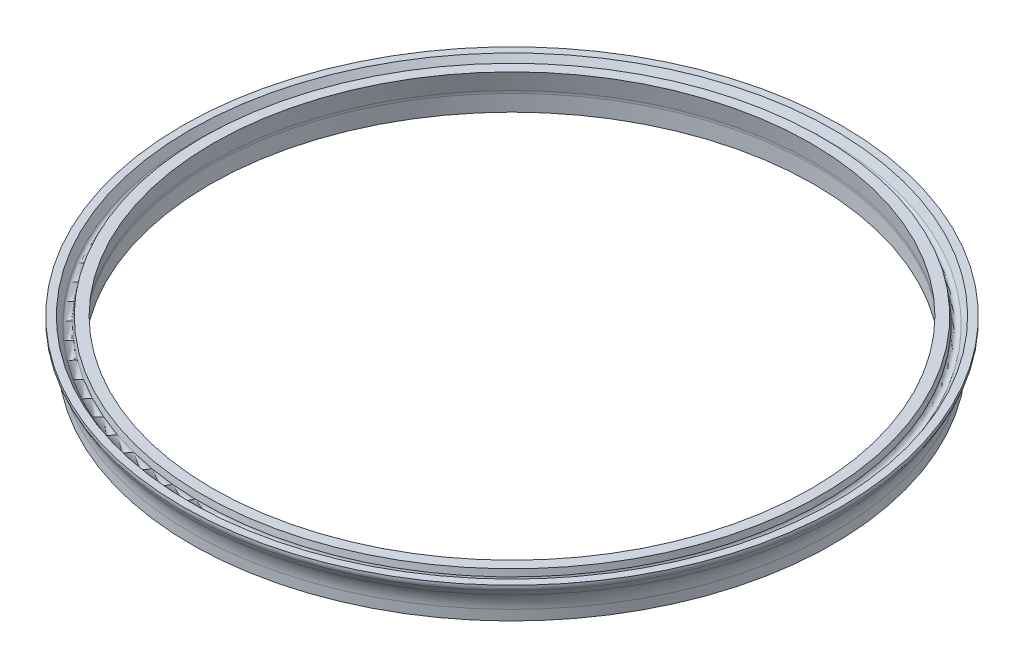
ISO-10303-21;
HEADER;
FILE_DESCRIPTION(('STEP AP214'),'2;1');
FILE_NAME('part.step','',(''),(''),'','','');
FILE_SCHEMA(('AUTOMOTIVE_DESIGN { 1 0 10303 214 1 1 1 1 }'));
ENDSEC;
DATA;
#1=APPLICATION_CONTEXT('core data for automotive mechanical design processes');
#2=APPLICATION_PROTOCOL_DEFINITION('international standard','automotive_design',2000,#1);
#3=PRODUCT_CONTEXT('',#1,'mechanical');
#4=PRODUCT('Part','Part','',(#3));
#5=PRODUCT_RELATED_PRODUCT_CATEGORY('part','',(#4));
#6=PRODUCT_DEFINITION_FORMATION('','',#4);
#7=PRODUCT_DEFINITION_CONTEXT('part definition',#1,'design');
#8=PRODUCT_DEFINITION('design','',#6,#7);
#9=PRODUCT_DEFINITION_SHAPE('','',#8);
#10=(LENGTH_UNIT() NAMED_UNIT(*) SI_UNIT(.MILLI.,.METRE.));
#11=(NAMED_UNIT(*) PLANE_ANGLE_UNIT() SI_UNIT($,.RADIAN.));
#12=(NAMED_UNIT(*) SI_UNIT($,.STERADIAN.) SOLID_ANGLE_UNIT());
#13=UNCERTAINTY_MEASURE_WITH_UNIT(LENGTH_MEASURE(1.E-05),#10,'distance_accuracy_value','');
#14=(GEOMETRIC_REPRESENTATION_CONTEXT(3) GLOBAL_UNCERTAINTY_ASSIGNED_CONTEXT((#13)) GLOBAL_UNIT_ASSIGNED_CONTEXT((#10,
#11,#12)) REPRESENTATION_CONTEXT('',''));
#15=CARTESIAN_POINT('',(0.,0.,0.));
#16=DIRECTION('',(0.,0.,1.));
#17=DIRECTION('',(1.,0.,0.));
#18=AXIS2_PLACEMENT_3D('',#15,#16,#17);
#19=CARTESIAN_POINT('',(80.1,82.911295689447,0.));
#20=DIRECTION('',(0.,-1.,0.));
#21=DIRECTION('',(1.,0.,0.));
#22=AXIS2_PLACEMENT_3D('',#19,#20,#21);
#23=CONICAL_SURFACE('',#22,78.7946131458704,0.164436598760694);
#24=CARTESIAN_POINT('',(80.1,87.7,0.));
#25=DIRECTION('',(0.,1.,0.));
#26=DIRECTION('',(-1.,0.,0.));
#27=AXIS2_PLACEMENT_3D('',#24,#25,#26);
#28=CIRCLE('',#27,78.);
#29=CARTESIAN_POINT('',(2.1,87.7,0.));
#30=VERTEX_POINT('',#29);
#31=EDGE_CURVE('E10',#30,#30,#28,.T.);
#32=ORIENTED_EDGE('',*,*,#31,.T.);
#33=EDGE_LOOP('',(#32));
#34=FACE_BOUND('',#33,.T.);
#35=CARTESIAN_POINT('',(80.1,82.911295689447,0.));
#36=DIRECTION('',(0.,1.,0.));
#37=DIRECTION('',(-1.,0.,0.));
#38=AXIS2_PLACEMENT_3D('',#35,#36,#37);
#39=CIRCLE('',#38,78.7946131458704);
#40=CARTESIAN_POINT('',(1.30538685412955,82.911295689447,0.));
#41=VERTEX_POINT('',#40);
#42=EDGE_CURVE('E76',#41,#41,#39,.T.);
#43=ORIENTED_EDGE('',*,*,#42,.F.);
#44=EDGE_LOOP('',(#43));
#45=FACE_BOUND('',#44,.T.);
#46=ADVANCED_FACE('F30',(#34,#45),#23,.F.);
#47=CARTESIAN_POINT('',(-0.636919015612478,87.7,0.));
#48=DIRECTION('',(0.,1.,0.));
#49=DIRECTION('',(-1.,0.,0.));
#50=AXIS2_PLACEMENT_3D('',#47,#48,#49);
#51=PLANE('',#50);
#52=CARTESIAN_POINT('',(80.1,87.7,0.));
#53=DIRECTION('',(0.,1.,0.));
#54=DIRECTION('',(-1.,0.,0.));
#55=AXIS2_PLACEMENT_3D('',#52,#53,#54);
#56=CIRCLE('',#55,80.7369190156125);
#57=CARTESIAN_POINT('',(-0.636919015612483,87.7,0.));
#58=VERTEX_POINT('',#57);
#59=EDGE_CURVE('E36',#58,#58,#56,.T.);
#60=ORIENTED_EDGE('',*,*,#59,.T.);
#61=EDGE_LOOP('',(#60));
#62=FACE_BOUND('',#61,.T.);
#63=ORIENTED_EDGE('',*,*,#31,.F.);
#64=EDGE_LOOP('',(#63));
#65=FACE_BOUND('',#64,.T.);
#66=ADVANCED_FACE('F84',(#62,#65),#51,.T.);
#67=CARTESIAN_POINT('',(80.1,87.7,0.));
#68=DIRECTION('',(0.,-1.,0.));
#69=DIRECTION('',(1.,0.,0.));
#70=AXIS2_PLACEMENT_3D('',#67,#68,#69);
#71=CONICAL_SURFACE('',#70,80.7369190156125,0.164436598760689);
#72=CARTESIAN_POINT('',(80.1,86.0487381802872,0.));
#73=DIRECTION('',(0.,1.,0.));
#74=DIRECTION('',(-1.,0.,0.));
#75=AXIS2_PLACEMENT_3D('',#72,#73,#74);
#76=CIRCLE('',#75,81.0109209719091);
#77=CARTESIAN_POINT('',(-0.910920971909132,86.0487381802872,0.));
#78=VERTEX_POINT('',#77);
#79=EDGE_CURVE('E40',#78,#78,#76,.T.);
#80=ORIENTED_EDGE('',*,*,#79,.T.);
#81=EDGE_LOOP('',(#80));
#82=FACE_BOUND('',#81,.T.);
#83=ORIENTED_EDGE('',*,*,#59,.F.);
#84=EDGE_LOOP('',(#83));
#85=FACE_BOUND('',#84,.T.);
#86=ADVANCED_FACE('F88',(#82,#85),#71,.T.);
#87=CARTESIAN_POINT('',(80.1,86.2124347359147,0.));
#88=DIRECTION('',(0.,1.,0.));
#89=DIRECTION('',(-1.,0.,0.));
#90=AXIS2_PLACEMENT_3D('',#87,#88,#89);
#91=TOROIDAL_SURFACE('',#90,81.9974317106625,1.);
#92=CARTESIAN_POINT('',(80.1,85.7044497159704,0.));
#93=DIRECTION('',(0.,1.,0.));
#94=DIRECTION('',(-1.,0.,0.));
#95=AXIS2_PLACEMENT_3D('',#92,#93,#94);
#96=CIRCLE('',#95,82.8587976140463);
#97=CARTESIAN_POINT('',(-2.75879761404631,85.7044497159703,0.));
#98=VERTEX_POINT('',#97);
#99=EDGE_CURVE('E44',#98,#98,#96,.T.);
#100=ORIENTED_EDGE('',*,*,#99,.T.);
#101=EDGE_LOOP('',(#100));
#102=FACE_BOUND('',#101,.T.);
#103=ORIENTED_EDGE('',*,*,#79,.F.);
#104=EDGE_LOOP('',(#103));
#105=FACE_BOUND('',#104,.T.);
#106=ADVANCED_FACE('F92',(#102,#105),#91,.F.);
#107=CARTESIAN_POINT('',(80.1,85.7044497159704,0.));
#108=DIRECTION('',(0.,1.,0.));
#109=DIRECTION('',(-1.,0.,0.));
#110=AXIS2_PLACEMENT_3D('',#107,#108,#109);
#111=CONICAL_SURFACE('',#110,82.8587976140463,0.53284388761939);
#112=CARTESIAN_POINT('',(80.1,87.7,0.));
#113=DIRECTION('',(0.,1.,0.));
#114=DIRECTION('',(-1.,0.,0.));
#115=AXIS2_PLACEMENT_3D('',#112,#113,#114);
#116=CIRCLE('',#115,84.0356606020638);
#117=CARTESIAN_POINT('',(-3.93566060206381,87.7,0.));
#118=VERTEX_POINT('',#117);
#119=EDGE_CURVE('E49',#118,#118,#116,.T.);
#120=ORIENTED_EDGE('',*,*,#119,.T.);
#121=EDGE_LOOP('',(#120));
#122=FACE_BOUND('',#121,.T.);
#123=ORIENTED_EDGE('',*,*,#99,.F.);
#124=EDGE_LOOP('',(#123));
#125=FACE_BOUND('',#124,.T.);
#126=ADVANCED_FACE('F99',(#122,#125),#111,.F.);
#127=CARTESIAN_POINT('',(-5.9,87.7,0.));
#128=DIRECTION('',(0.,1.,0.));
#129=DIRECTION('',(-1.,0.,0.));
#130=AXIS2_PLACEMENT_3D('',#127,#128,#129);
#131=PLANE('',#130);
#132=CARTESIAN_POINT('',(80.1,87.7,0.));
#133=DIRECTION('',(0.,1.,0.));
#134=DIRECTION('',(-1.,0.,0.));
#135=AXIS2_PLACEMENT_3D('',#132,#133,#134);
#136=CIRCLE('',#135,86.);
#137=CARTESIAN_POINT('',(-5.9,87.7,0.));
#138=VERTEX_POINT('',#137);
#139=EDGE_CURVE('E52',#138,#138,#136,.T.);
#140=ORIENTED_EDGE('',*,*,#139,.T.);
#141=EDGE_LOOP('',(#140));
#142=FACE_BOUND('',#141,.T.);
#143=ORIENTED_EDGE('',*,*,#119,.F.);
#144=EDGE_LOOP('',(#143));
#145=FACE_BOUND('',#144,.T.);
#146=ADVANCED_FACE('F103',(#142,#145),#131,.T.);
#147=CARTESIAN_POINT('',(80.1,96.925,0.));
#148=DIRECTION('',(0.,1.,0.));
#149=DIRECTION('',(-1.,0.,0.));
#150=AXIS2_PLACEMENT_3D('',#147,#148,#149);
#151=CYLINDRICAL_SURFACE('',#150,86.);
#152=CARTESIAN_POINT('',(80.1,86.9729098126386,0.));
#153=DIRECTION('',(0.,1.,0.));
#154=DIRECTION('',(-1.,0.,0.));
#155=AXIS2_PLACEMENT_3D('',#152,#153,#154);
#156=CIRCLE('',#155,86.);
#157=CARTESIAN_POINT('',(-5.9,86.9729098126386,0.));
#158=VERTEX_POINT('',#157);
#159=EDGE_CURVE('E55',#158,#158,#156,.T.);
#160=ORIENTED_EDGE('',*,*,#159,.T.);
#161=EDGE_LOOP('',(#160));
#162=FACE_BOUND('',#161,.T.);
#163=ORIENTED_EDGE('',*,*,#139,.F.);
#164=EDGE_LOOP('',(#163));
#165=FACE_BOUND('',#164,.T.);
#166=ADVANCED_FACE('F107',(#162,#165),#151,.T.);
#167=CARTESIAN_POINT('',(80.1,86.9729098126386,0.));
#168=DIRECTION('',(0.,1.,0.));
#169=DIRECTION('',(-1.,0.,0.));
#170=AXIS2_PLACEMENT_3D('',#167,#168,#169);
#171=TOROIDAL_SURFACE('',#170,85.,1.00000000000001);
#172=CARTESIAN_POINT('',(80.1,86.4649247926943,0.));
#173=DIRECTION('',(0.,1.,0.));
#174=DIRECTION('',(-1.,0.,0.));
#175=AXIS2_PLACEMENT_3D('',#172,#173,#174);
#176=CIRCLE('',#175,85.8613659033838);
#177=CARTESIAN_POINT('',(-5.7613659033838,86.4649247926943,0.));
#178=VERTEX_POINT('',#177);
#179=EDGE_CURVE('E58',#178,#178,#176,.T.);
#180=ORIENTED_EDGE('',*,*,#179,.T.);
#181=EDGE_LOOP('',(#180));
#182=FACE_BOUND('',#181,.T.);
#183=ORIENTED_EDGE('',*,*,#159,.F.);
#184=EDGE_LOOP('',(#183));
#185=FACE_BOUND('',#184,.T.);
#186=ADVANCED_FACE('F111',(#182,#185),#171,.T.);
#187=CARTESIAN_POINT('',(80.1,86.4649247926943,0.));
#188=DIRECTION('',(0.,1.,0.));
#189=DIRECTION('',(-1.,0.,0.));
#190=AXIS2_PLACEMENT_3D('',#187,#188,#189);
#191=CONICAL_SURFACE('',#190,85.8613659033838,0.532843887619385);
#192=CARTESIAN_POINT('',(80.1,84.6806016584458,0.));
#193=DIRECTION('',(0.,1.,0.));
#194=DIRECTION('',(-1.,0.,0.));
#195=AXIS2_PLACEMENT_3D('',#192,#193,#194);
#196=CIRCLE('',#195,84.8090727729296);
#197=CARTESIAN_POINT('',(-4.70907277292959,84.6806016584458,0.));
#198=VERTEX_POINT('',#197);
#199=EDGE_CURVE('E61',#198,#198,#196,.T.);
#200=ORIENTED_EDGE('',*,*,#199,.T.);
#201=EDGE_LOOP('',(#200));
#202=FACE_BOUND('',#201,.T.);
#203=ORIENTED_EDGE('',*,*,#179,.F.);
#204=EDGE_LOOP('',(#203));
#205=FACE_BOUND('',#204,.T.);
#206=ADVANCED_FACE('F115',(#202,#205),#191,.T.);
#207=CARTESIAN_POINT('',(80.1,80.6167214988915,0.));
#208=DIRECTION('',(0.,1.,0.));
#209=DIRECTION('',(-1.,0.,0.));
#210=AXIS2_PLACEMENT_3D('',#207,#208,#209);
#211=TOROIDAL_SURFACE('',#210,91.7,7.99999999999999);
#212=CARTESIAN_POINT('',(80.1,80.6167214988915,0.));
#213=DIRECTION('',(0.,1.,0.));
#214=DIRECTION('',(-1.,0.,0.));
#215=AXIS2_PLACEMENT_3D('',#212,#213,#214);
#216=CIRCLE('',#215,83.7);
#217=CARTESIAN_POINT('',(-3.60000000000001,80.6167214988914,0.));
#218=VERTEX_POINT('',#217);
#219=EDGE_CURVE('E64',#218,#218,#216,.T.);
#220=ORIENTED_EDGE('',*,*,#219,.T.);
#221=EDGE_LOOP('',(#220));
#222=FACE_BOUND('',#221,.T.);
#223=ORIENTED_EDGE('',*,*,#199,.F.);
#224=EDGE_LOOP('',(#223));
#225=FACE_BOUND('',#224,.T.);
#226=ADVANCED_FACE('F119',(#222,#225),#211,.F.);
#227=CARTESIAN_POINT('',(80.1,96.925,0.));
#228=DIRECTION('',(0.,1.,0.));
#229=DIRECTION('',(-1.,0.,0.));
#230=AXIS2_PLACEMENT_3D('',#227,#228,#229);
#231=CYLINDRICAL_SURFACE('',#230,83.7);
#232=CARTESIAN_POINT('',(80.1,78.,0.));
#233=DIRECTION('',(0.,1.,0.));
#234=DIRECTION('',(-1.,0.,0.));
#235=AXIS2_PLACEMENT_3D('',#232,#233,#234);
#236=CIRCLE('',#235,83.7);
#237=CARTESIAN_POINT('',(-3.60000000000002,78.,0.));
#238=VERTEX_POINT('',#237);
#239=EDGE_CURVE('E67',#238,#238,#236,.T.);
#240=ORIENTED_EDGE('',*,*,#239,.T.);
#241=EDGE_LOOP('',(#240));
#242=FACE_BOUND('',#241,.T.);
#243=ORIENTED_EDGE('',*,*,#219,.F.);
#244=EDGE_LOOP('',(#243));
#245=FACE_BOUND('',#244,.T.);
#246=ADVANCED_FACE('F123',(#242,#245),#231,.T.);
#247=CARTESIAN_POINT('',(-3.60000000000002,78.,0.));
#248=DIRECTION('',(0.,-1.,0.));
#249=DIRECTION('',(1.,0.,0.));
#250=AXIS2_PLACEMENT_3D('',#247,#248,#249);
#251=PLANE('',#250);
#252=CARTESIAN_POINT('',(80.1,78.,0.));
#253=DIRECTION('',(0.,1.,0.));
#254=DIRECTION('',(-1.,0.,0.));
#255=AXIS2_PLACEMENT_3D('',#252,#253,#254);
#256=CIRCLE('',#255,78.848570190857);
#257=CARTESIAN_POINT('',(1.25142980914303,78.,0.));
#258=VERTEX_POINT('',#257);
#259=EDGE_CURVE('E70',#258,#258,#256,.T.);
#260=ORIENTED_EDGE('',*,*,#259,.T.);
#261=EDGE_LOOP('',(#260));
#262=FACE_BOUND('',#261,.T.);
#263=ORIENTED_EDGE('',*,*,#239,.F.);
#264=EDGE_LOOP('',(#263));
#265=FACE_BOUND('',#264,.T.);
#266=ADVANCED_FACE('F127',(#262,#265),#251,.T.);
#267=CARTESIAN_POINT('',(80.1,96.925,0.));
#268=DIRECTION('',(0.,1.,0.));
#269=DIRECTION('',(-1.,0.,0.));
#270=AXIS2_PLACEMENT_3D('',#267,#268,#269);
#271=CYLINDRICAL_SURFACE('',#270,78.848570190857);
#272=CARTESIAN_POINT('',(80.1,82.2565094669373,0.));
#273=DIRECTION('',(0.,1.,0.));
#274=DIRECTION('',(-1.,0.,0.));
#275=AXIS2_PLACEMENT_3D('',#272,#273,#274);
#276=CIRCLE('',#275,78.848570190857);
#277=CARTESIAN_POINT('',(1.25142980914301,82.2565094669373,0.));
#278=VERTEX_POINT('',#277);
#279=EDGE_CURVE('E73',#278,#278,#276,.T.);
#280=ORIENTED_EDGE('',*,*,#279,.T.);
#281=EDGE_LOOP('',(#280));
#282=FACE_BOUND('',#281,.T.);
#283=ORIENTED_EDGE('',*,*,#259,.F.);
#284=EDGE_LOOP('',(#283));
#285=FACE_BOUND('',#284,.T.);
#286=ADVANCED_FACE('F131',(#282,#285),#271,.F.);
#287=CARTESIAN_POINT('',(80.1,82.2565094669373,0.));
#288=DIRECTION('',(0.,1.,0.));
#289=DIRECTION('',(-1.,0.,0.));
#290=AXIS2_PLACEMENT_3D('',#287,#288,#289);
#291=TOROIDAL_SURFACE('',#290,74.848570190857,4.);
#292=ORIENTED_EDGE('',*,*,#42,.T.);
#293=EDGE_LOOP('',(#292));
#294=FACE_BOUND('',#293,.T.);
#295=ORIENTED_EDGE('',*,*,#279,.F.);
#296=EDGE_LOOP('',(#295));
#297=FACE_BOUND('',#296,.T.);
#298=ADVANCED_FACE('F80',(#294,#297),#291,.F.);
#299=CLOSED_SHELL('',(#46,#66,#86,#106,#126,#146,#166,#186,#206,#226,#246,#266,#286,#298));
#300=MANIFOLD_SOLID_BREP('B2',#299);
#301=ADVANCED_BREP_SHAPE_REPRESENTATION('',(#18,#300),#14);
#302=SHAPE_DEFINITION_REPRESENTATION(#9,#301);
ENDSEC;
END-ISO-10303-21;
